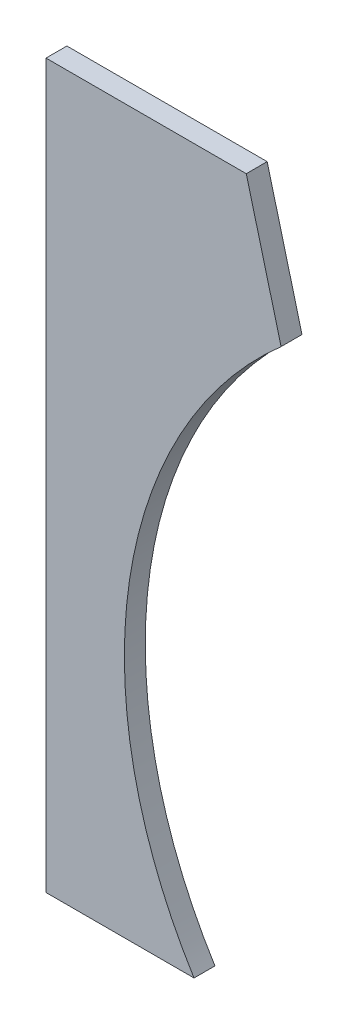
from build123d import *

# Parameters (mm, degrees)
EXTRUSION1_DEPTH = 12


with BuildPart() as part:
    # Esquisse1 → Extrusion1 (new body)
    with BuildSketch(Plane.XY):
        with BuildLine():
            Line((85, -140), (0, -140))
            Line((0, -140), (0, 275))
            Line((0, 275), (115, 275))
            Line((115, 275), (135, 198.997487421))
            ThreePointArc((135, 198.997487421), (47.836264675, 38.667504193), (85, -140))
        make_face()
    extrude(amount=EXTRUSION1_DEPTH)


solid = part.part
